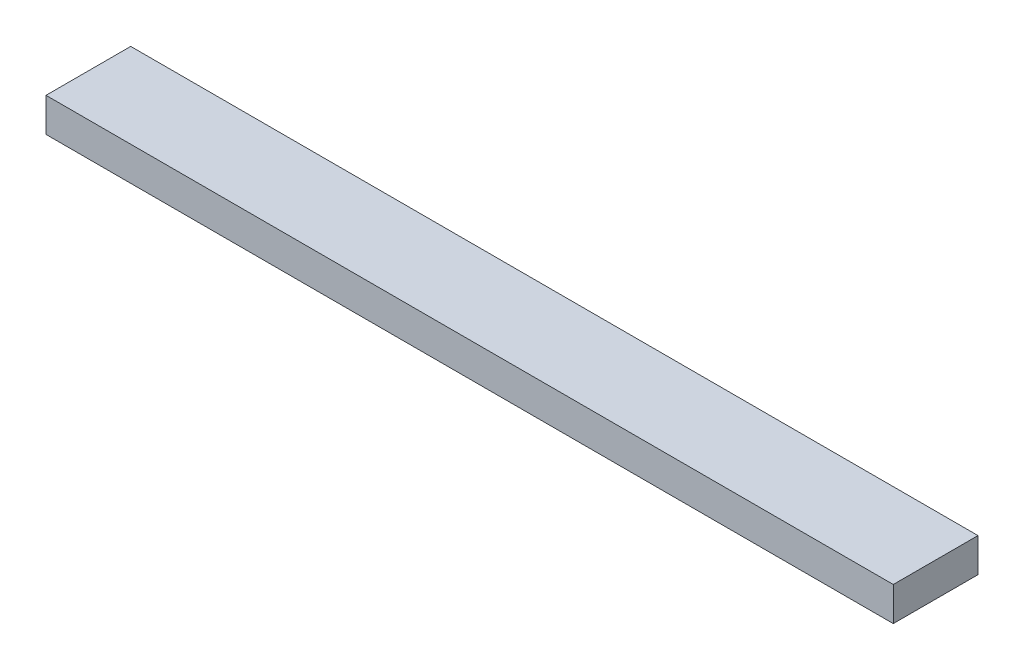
ISO-10303-21;
HEADER;
FILE_DESCRIPTION(('STEP AP214'),'2;1');
FILE_NAME('part.step','',(''),(''),'','','');
FILE_SCHEMA(('AUTOMOTIVE_DESIGN { 1 0 10303 214 1 1 1 1 }'));
ENDSEC;
DATA;
#1=APPLICATION_CONTEXT('core data for automotive mechanical design processes');
#2=APPLICATION_PROTOCOL_DEFINITION('international standard','automotive_design',2000,#1);
#3=PRODUCT_CONTEXT('',#1,'mechanical');
#4=PRODUCT('Part','Part','',(#3));
#5=PRODUCT_RELATED_PRODUCT_CATEGORY('part','',(#4));
#6=PRODUCT_DEFINITION_FORMATION('','',#4);
#7=PRODUCT_DEFINITION_CONTEXT('part definition',#1,'design');
#8=PRODUCT_DEFINITION('design','',#6,#7);
#9=PRODUCT_DEFINITION_SHAPE('','',#8);
#10=(LENGTH_UNIT() NAMED_UNIT(*) SI_UNIT(.MILLI.,.METRE.));
#11=(NAMED_UNIT(*) PLANE_ANGLE_UNIT() SI_UNIT($,.RADIAN.));
#12=(NAMED_UNIT(*) SI_UNIT($,.STERADIAN.) SOLID_ANGLE_UNIT());
#13=UNCERTAINTY_MEASURE_WITH_UNIT(LENGTH_MEASURE(1.E-05),#10,'distance_accuracy_value','');
#14=(GEOMETRIC_REPRESENTATION_CONTEXT(3) GLOBAL_UNCERTAINTY_ASSIGNED_CONTEXT((#13)) GLOBAL_UNIT_ASSIGNED_CONTEXT((#10,
#11,#12)) REPRESENTATION_CONTEXT('',''));
#15=CARTESIAN_POINT('',(0.,0.,0.));
#16=DIRECTION('',(0.,0.,1.));
#17=DIRECTION('',(1.,0.,0.));
#18=AXIS2_PLACEMENT_3D('',#15,#16,#17);
#19=CARTESIAN_POINT('',(-250.,-20.,0.));
#20=DIRECTION('',(0.,0.,-1.));
#21=DIRECTION('',(-1.,0.,0.));
#22=AXIS2_PLACEMENT_3D('',#19,#20,#21);
#23=PLANE('',#22);
#24=DIRECTION('',(-1.,0.,0.));
#25=VECTOR('',#24,1.);
#26=CARTESIAN_POINT('',(-250.,0.,0.));
#27=LINE('',#26,#25);
#28=CARTESIAN_POINT('',(250.,0.,0.));
#29=VERTEX_POINT('',#28);
#30=CARTESIAN_POINT('',(-250.,0.,0.));
#31=VERTEX_POINT('',#30);
#32=EDGE_CURVE('E101',#29,#31,#27,.T.);
#33=ORIENTED_EDGE('',*,*,#32,.F.);
#34=DIRECTION('',(0.,1.,0.));
#35=VECTOR('',#34,1.);
#36=CARTESIAN_POINT('',(250.,-20.,0.));
#37=LINE('',#36,#35);
#38=CARTESIAN_POINT('',(250.,-20.,0.));
#39=VERTEX_POINT('',#38);
#40=EDGE_CURVE('E11',#39,#29,#37,.T.);
#41=ORIENTED_EDGE('',*,*,#40,.F.);
#42=DIRECTION('',(-1.,0.,0.));
#43=VECTOR('',#42,1.);
#44=CARTESIAN_POINT('',(-250.,-20.,0.));
#45=LINE('',#44,#43);
#46=CARTESIAN_POINT('',(-250.,-20.,0.));
#47=VERTEX_POINT('',#46);
#48=EDGE_CURVE('E95',#39,#47,#45,.T.);
#49=ORIENTED_EDGE('',*,*,#48,.T.);
#50=DIRECTION('',(0.,1.,0.));
#51=VECTOR('',#50,1.);
#52=CARTESIAN_POINT('',(-250.,-20.,0.));
#53=LINE('',#52,#51);
#54=EDGE_CURVE('E40',#47,#31,#53,.T.);
#55=ORIENTED_EDGE('',*,*,#54,.T.);
#56=EDGE_LOOP('',(#33,#41,#49,#55));
#57=FACE_BOUND('',#56,.T.);
#58=ADVANCED_FACE('F37',(#57),#23,.T.);
#59=CARTESIAN_POINT('',(250.,-20.,50.));
#60=DIRECTION('',(1.,0.,0.));
#61=DIRECTION('',(0.,0.,-1.));
#62=AXIS2_PLACEMENT_3D('',#59,#60,#61);
#63=PLANE('',#62);
#64=DIRECTION('',(0.,0.,-1.));
#65=VECTOR('',#64,1.);
#66=CARTESIAN_POINT('',(250.,0.,50.));
#67=LINE('',#66,#65);
#68=CARTESIAN_POINT('',(250.,0.,50.));
#69=VERTEX_POINT('',#68);
#70=EDGE_CURVE('E97',#69,#29,#67,.T.);
#71=ORIENTED_EDGE('',*,*,#70,.F.);
#72=DIRECTION('',(0.,1.,0.));
#73=VECTOR('',#72,1.);
#74=CARTESIAN_POINT('',(250.,-20.,50.));
#75=LINE('',#74,#73);
#76=CARTESIAN_POINT('',(250.,-20.,50.));
#77=VERTEX_POINT('',#76);
#78=EDGE_CURVE('E46',#77,#69,#75,.T.);
#79=ORIENTED_EDGE('',*,*,#78,.F.);
#80=DIRECTION('',(0.,0.,-1.));
#81=VECTOR('',#80,1.);
#82=CARTESIAN_POINT('',(250.,-20.,50.));
#83=LINE('',#82,#81);
#84=EDGE_CURVE('E92',#77,#39,#83,.T.);
#85=ORIENTED_EDGE('',*,*,#84,.T.);
#86=ORIENTED_EDGE('',*,*,#40,.T.);
#87=EDGE_LOOP('',(#71,#79,#85,#86));
#88=FACE_BOUND('',#87,.T.);
#89=ADVANCED_FACE('F111',(#88),#63,.T.);
#90=CARTESIAN_POINT('',(-250.,-20.,50.));
#91=DIRECTION('',(0.,0.,1.));
#92=DIRECTION('',(1.,0.,0.));
#93=AXIS2_PLACEMENT_3D('',#90,#91,#92);
#94=PLANE('',#93);
#95=DIRECTION('',(1.,0.,0.));
#96=VECTOR('',#95,1.);
#97=CARTESIAN_POINT('',(-250.,0.,50.));
#98=LINE('',#97,#96);
#99=CARTESIAN_POINT('',(-250.,0.,50.));
#100=VERTEX_POINT('',#99);
#101=EDGE_CURVE('E87',#100,#69,#98,.T.);
#102=ORIENTED_EDGE('',*,*,#101,.F.);
#103=DIRECTION('',(0.,1.,0.));
#104=VECTOR('',#103,1.);
#105=CARTESIAN_POINT('',(-250.,-20.,50.));
#106=LINE('',#105,#104);
#107=CARTESIAN_POINT('',(-250.,-20.,50.));
#108=VERTEX_POINT('',#107);
#109=EDGE_CURVE('E82',#108,#100,#106,.T.);
#110=ORIENTED_EDGE('',*,*,#109,.F.);
#111=DIRECTION('',(1.,0.,0.));
#112=VECTOR('',#111,1.);
#113=CARTESIAN_POINT('',(-250.,-20.,50.));
#114=LINE('',#113,#112);
#115=EDGE_CURVE('E85',#108,#77,#114,.T.);
#116=ORIENTED_EDGE('',*,*,#115,.T.);
#117=ORIENTED_EDGE('',*,*,#78,.T.);
#118=EDGE_LOOP('',(#102,#110,#116,#117));
#119=FACE_BOUND('',#118,.T.);
#120=ADVANCED_FACE('F84',(#119),#94,.T.);
#121=CARTESIAN_POINT('',(-250.,-20.,0.));
#122=DIRECTION('',(-1.,0.,0.));
#123=DIRECTION('',(0.,0.,1.));
#124=AXIS2_PLACEMENT_3D('',#121,#122,#123);
#125=PLANE('',#124);
#126=DIRECTION('',(0.,0.,1.));
#127=VECTOR('',#126,1.);
#128=CARTESIAN_POINT('',(-250.,0.,0.));
#129=LINE('',#128,#127);
#130=EDGE_CURVE('E104',#31,#100,#129,.T.);
#131=ORIENTED_EDGE('',*,*,#130,.F.);
#132=ORIENTED_EDGE('',*,*,#54,.F.);
#133=DIRECTION('',(0.,0.,1.));
#134=VECTOR('',#133,1.);
#135=CARTESIAN_POINT('',(-250.,-20.,0.));
#136=LINE('',#135,#134);
#137=EDGE_CURVE('E91',#47,#108,#136,.T.);
#138=ORIENTED_EDGE('',*,*,#137,.T.);
#139=ORIENTED_EDGE('',*,*,#109,.T.);
#140=EDGE_LOOP('',(#131,#132,#138,#139));
#141=FACE_BOUND('',#140,.T.);
#142=ADVANCED_FACE('F94',(#141),#125,.T.);
#143=CARTESIAN_POINT('',(0.,-20.,0.));
#144=DIRECTION('',(0.,1.,0.));
#145=DIRECTION('',(0.,0.,1.));
#146=AXIS2_PLACEMENT_3D('',#143,#144,#145);
#147=PLANE('',#146);
#148=ORIENTED_EDGE('',*,*,#48,.F.);
#149=ORIENTED_EDGE('',*,*,#84,.F.);
#150=ORIENTED_EDGE('',*,*,#115,.F.);
#151=ORIENTED_EDGE('',*,*,#137,.F.);
#152=EDGE_LOOP('',(#148,#149,#150,#151));
#153=FACE_BOUND('',#152,.T.);
#154=ADVANCED_FACE('F90',(#153),#147,.F.);
#155=CARTESIAN_POINT('',(0.,0.,0.));
#156=DIRECTION('',(0.,1.,0.));
#157=DIRECTION('',(0.,0.,1.));
#158=AXIS2_PLACEMENT_3D('',#155,#156,#157);
#159=PLANE('',#158);
#160=ORIENTED_EDGE('',*,*,#32,.T.);
#161=ORIENTED_EDGE('',*,*,#130,.T.);
#162=ORIENTED_EDGE('',*,*,#101,.T.);
#163=ORIENTED_EDGE('',*,*,#70,.T.);
#164=EDGE_LOOP('',(#160,#161,#162,#163));
#165=FACE_BOUND('',#164,.T.);
#166=ADVANCED_FACE('F110',(#165),#159,.T.);
#167=CLOSED_SHELL('',(#58,#89,#120,#142,#154,#166));
#168=MANIFOLD_SOLID_BREP('B2',#167);
#169=ADVANCED_BREP_SHAPE_REPRESENTATION('',(#18,#168),#14);
#170=SHAPE_DEFINITION_REPRESENTATION(#9,#169);
ENDSEC;
END-ISO-10303-21;
